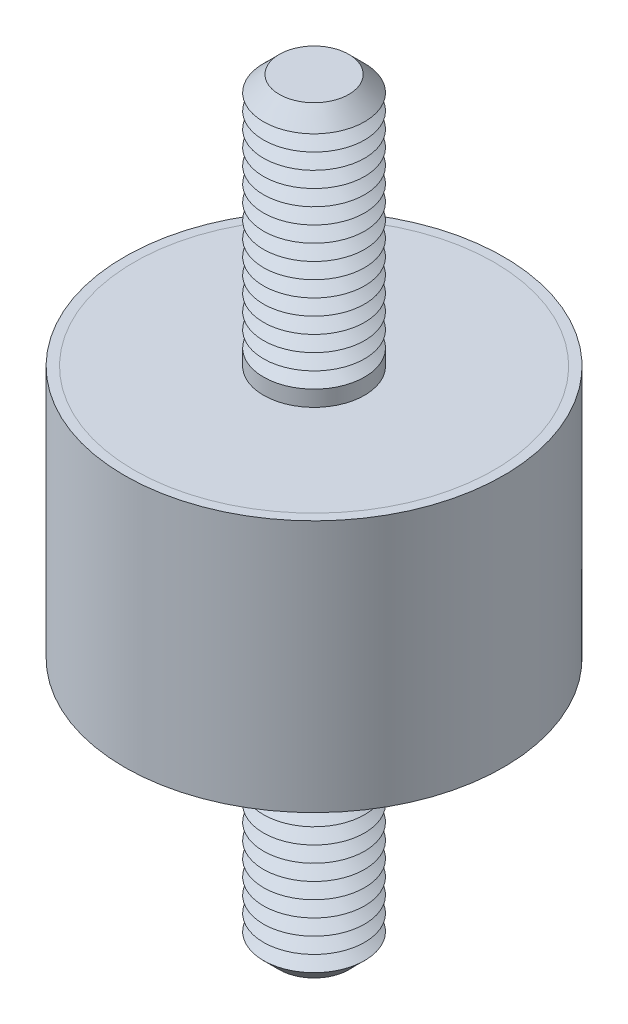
ISO-10303-21;
HEADER;
FILE_DESCRIPTION(('STEP AP214'),'2;1');
FILE_NAME('part.step','',(''),(''),'','','');
FILE_SCHEMA(('AUTOMOTIVE_DESIGN { 1 0 10303 214 1 1 1 1 }'));
ENDSEC;
DATA;
#1=APPLICATION_CONTEXT('core data for automotive mechanical design processes');
#2=APPLICATION_PROTOCOL_DEFINITION('international standard','automotive_design',2000,#1);
#3=PRODUCT_CONTEXT('',#1,'mechanical');
#4=PRODUCT('Part','Part','',(#3));
#5=PRODUCT_RELATED_PRODUCT_CATEGORY('part','',(#4));
#6=PRODUCT_DEFINITION_FORMATION('','',#4);
#7=PRODUCT_DEFINITION_CONTEXT('part definition',#1,'design');
#8=PRODUCT_DEFINITION('design','',#6,#7);
#9=PRODUCT_DEFINITION_SHAPE('','',#8);
#10=(LENGTH_UNIT() NAMED_UNIT(*) SI_UNIT(.MILLI.,.METRE.));
#11=(NAMED_UNIT(*) PLANE_ANGLE_UNIT() SI_UNIT($,.RADIAN.));
#12=(NAMED_UNIT(*) SI_UNIT($,.STERADIAN.) SOLID_ANGLE_UNIT());
#13=UNCERTAINTY_MEASURE_WITH_UNIT(LENGTH_MEASURE(1.E-05),#10,'distance_accuracy_value','');
#14=(GEOMETRIC_REPRESENTATION_CONTEXT(3) GLOBAL_UNCERTAINTY_ASSIGNED_CONTEXT((#13)) GLOBAL_UNIT_ASSIGNED_CONTEXT((#10,
#11,#12)) REPRESENTATION_CONTEXT('',''));
#15=CARTESIAN_POINT('',(0.,0.,0.));
#16=DIRECTION('',(0.,0.,1.));
#17=DIRECTION('',(1.,0.,0.));
#18=AXIS2_PLACEMENT_3D('',#15,#16,#17);
#19=CARTESIAN_POINT('',(0.,-30.,0.));
#20=DIRECTION('',(0.,1.,0.));
#21=DIRECTION('',(0.,0.,1.));
#22=AXIS2_PLACEMENT_3D('',#19,#20,#21);
#23=CYLINDRICAL_SURFACE('',#22,4.);
#24=CARTESIAN_POINT('',(0.,-10.,0.));
#25=DIRECTION('',(0.,-1.,0.));
#26=DIRECTION('',(0.,0.,-1.));
#27=AXIS2_PLACEMENT_3D('',#24,#25,#26);
#28=CIRCLE('',#27,4.);
#29=CARTESIAN_POINT('',(0.,-10.,-4.));
#30=VERTEX_POINT('',#29);
#31=EDGE_CURVE('P0_E21',#30,#30,#28,.T.);
#32=ORIENTED_EDGE('',*,*,#31,.T.);
#33=EDGE_LOOP('',(#32));
#34=FACE_BOUND('',#33,.T.);
#35=CARTESIAN_POINT('',(0.,-11.25,0.));
#36=DIRECTION('',(0.,1.,0.));
#37=DIRECTION('',(0.,0.,1.));
#38=AXIS2_PLACEMENT_3D('',#35,#36,#37);
#39=CIRCLE('',#38,4.);
#40=CARTESIAN_POINT('',(0.,-11.25,4.));
#41=VERTEX_POINT('',#40);
#42=EDGE_CURVE('P0_E33',#41,#41,#39,.T.);
#43=ORIENTED_EDGE('',*,*,#42,.T.);
#44=EDGE_LOOP('',(#43));
#45=FACE_BOUND('',#44,.T.);
#46=ADVANCED_FACE('P0_F14',(#34,#45),#23,.T.);
#47=CARTESIAN_POINT('',(0.,-10.,0.));
#48=DIRECTION('',(0.,1.,0.));
#49=DIRECTION('',(0.,0.,1.));
#50=AXIS2_PLACEMENT_3D('',#47,#48,#49);
#51=CYLINDRICAL_SURFACE('',#50,14.25);
#52=CARTESIAN_POINT('',(0.,-10.,0.));
#53=DIRECTION('',(0.,1.,0.));
#54=DIRECTION('',(0.,0.,1.));
#55=AXIS2_PLACEMENT_3D('',#52,#53,#54);
#56=CIRCLE('',#55,14.25);
#57=CARTESIAN_POINT('',(0.,-10.,14.25));
#58=VERTEX_POINT('',#57);
#59=EDGE_CURVE('P0_E25',#58,#58,#56,.T.);
#60=ORIENTED_EDGE('',*,*,#59,.T.);
#61=EDGE_LOOP('',(#60));
#62=FACE_BOUND('',#61,.T.);
#63=CARTESIAN_POINT('',(0.,-9.,0.));
#64=DIRECTION('',(0.,1.,0.));
#65=DIRECTION('',(0.,0.,1.));
#66=AXIS2_PLACEMENT_3D('',#63,#64,#65);
#67=CIRCLE('',#66,14.25);
#68=CARTESIAN_POINT('',(0.,-9.,14.25));
#69=VERTEX_POINT('',#68);
#70=EDGE_CURVE('P0_E30',#69,#69,#67,.T.);
#71=ORIENTED_EDGE('',*,*,#70,.F.);
#72=EDGE_LOOP('',(#71));
#73=FACE_BOUND('',#72,.T.);
#74=ADVANCED_FACE('P0_F145',(#62,#73),#51,.T.);
#75=CARTESIAN_POINT('',(0.,-10.,0.));
#76=DIRECTION('',(0.,1.,0.));
#77=DIRECTION('',(0.,0.,1.));
#78=AXIS2_PLACEMENT_3D('',#75,#76,#77);
#79=PLANE('',#78);
#80=ORIENTED_EDGE('',*,*,#31,.F.);
#81=EDGE_LOOP('',(#80));
#82=FACE_BOUND('',#81,.T.);
#83=ORIENTED_EDGE('',*,*,#59,.F.);
#84=EDGE_LOOP('',(#83));
#85=FACE_BOUND('',#84,.T.);
#86=ADVANCED_FACE('P0_F150',(#82,#85),#79,.F.);
#87=CARTESIAN_POINT('',(0.,-9.,0.));
#88=DIRECTION('',(0.,1.,0.));
#89=DIRECTION('',(0.,0.,1.));
#90=AXIS2_PLACEMENT_3D('',#87,#88,#89);
#91=PLANE('',#90);
#92=ORIENTED_EDGE('',*,*,#70,.T.);
#93=EDGE_LOOP('',(#92));
#94=FACE_BOUND('',#93,.T.);
#95=ADVANCED_FACE('P0_F156',(#94),#91,.T.);
#96=CARTESIAN_POINT('',(0.,-11.25,0.));
#97=DIRECTION('',(0.,1.,0.));
#98=DIRECTION('',(0.,0.,1.));
#99=AXIS2_PLACEMENT_3D('',#96,#97,#98);
#100=CONICAL_SURFACE('',#99,4.,1.0471975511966);
#101=CARTESIAN_POINT('',(0.,-11.875,0.));
#102=DIRECTION('',(0.,1.,0.));
#103=DIRECTION('',(0.,0.,1.));
#104=AXIS2_PLACEMENT_3D('',#101,#102,#103);
#105=CIRCLE('',#104,2.91746824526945);
#106=CARTESIAN_POINT('',(0.,-11.875,2.91746824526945));
#107=VERTEX_POINT('',#106);
#108=EDGE_CURVE('P0_E39',#107,#107,#105,.T.);
#109=ORIENTED_EDGE('',*,*,#108,.T.);
#110=EDGE_LOOP('',(#109));
#111=FACE_BOUND('',#110,.T.);
#112=ORIENTED_EDGE('',*,*,#42,.F.);
#113=EDGE_LOOP('',(#112));
#114=FACE_BOUND('',#113,.T.);
#115=ADVANCED_FACE('P0_F159',(#111,#114),#100,.T.);
#116=CARTESIAN_POINT('',(0.,-11.875,0.));
#117=DIRECTION('',(0.,-1.,0.));
#118=DIRECTION('',(0.,0.,-1.));
#119=AXIS2_PLACEMENT_3D('',#116,#117,#118);
#120=CONICAL_SURFACE('',#119,2.91746824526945,1.04719755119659);
#121=CARTESIAN_POINT('',(0.,-12.5,0.));
#122=DIRECTION('',(0.,1.,0.));
#123=DIRECTION('',(0.,0.,1.));
#124=AXIS2_PLACEMENT_3D('',#121,#122,#123);
#125=CIRCLE('',#124,4.);
#126=CARTESIAN_POINT('',(0.,-12.5,4.));
#127=VERTEX_POINT('',#126);
#128=EDGE_CURVE('P0_E43',#127,#127,#125,.T.);
#129=ORIENTED_EDGE('',*,*,#128,.T.);
#130=EDGE_LOOP('',(#129));
#131=FACE_BOUND('',#130,.T.);
#132=ORIENTED_EDGE('',*,*,#108,.F.);
#133=EDGE_LOOP('',(#132));
#134=FACE_BOUND('',#133,.T.);
#135=ADVANCED_FACE('P0_F163',(#131,#134),#120,.T.);
#136=CARTESIAN_POINT('',(0.,-12.5,0.));
#137=DIRECTION('',(0.,1.,0.));
#138=DIRECTION('',(0.,0.,1.));
#139=AXIS2_PLACEMENT_3D('',#136,#137,#138);
#140=CONICAL_SURFACE('',#139,4.,1.0471975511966);
#141=CARTESIAN_POINT('',(0.,-13.125,0.));
#142=DIRECTION('',(0.,1.,0.));
#143=DIRECTION('',(0.,0.,1.));
#144=AXIS2_PLACEMENT_3D('',#141,#142,#143);
#145=CIRCLE('',#144,2.91746824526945);
#146=CARTESIAN_POINT('',(0.,-13.125,2.91746824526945));
#147=VERTEX_POINT('',#146);
#148=EDGE_CURVE('P0_E47',#147,#147,#145,.T.);
#149=ORIENTED_EDGE('',*,*,#148,.T.);
#150=EDGE_LOOP('',(#149));
#151=FACE_BOUND('',#150,.T.);
#152=ORIENTED_EDGE('',*,*,#128,.F.);
#153=EDGE_LOOP('',(#152));
#154=FACE_BOUND('',#153,.T.);
#155=ADVANCED_FACE('P0_F167',(#151,#154),#140,.T.);
#156=CARTESIAN_POINT('',(0.,-13.125,0.));
#157=DIRECTION('',(0.,-1.,0.));
#158=DIRECTION('',(0.,0.,-1.));
#159=AXIS2_PLACEMENT_3D('',#156,#157,#158);
#160=CONICAL_SURFACE('',#159,2.91746824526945,1.04719755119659);
#161=CARTESIAN_POINT('',(0.,-13.75,0.));
#162=DIRECTION('',(0.,1.,0.));
#163=DIRECTION('',(0.,0.,1.));
#164=AXIS2_PLACEMENT_3D('',#161,#162,#163);
#165=CIRCLE('',#164,4.);
#166=CARTESIAN_POINT('',(0.,-13.75,4.));
#167=VERTEX_POINT('',#166);
#168=EDGE_CURVE('P0_E52',#167,#167,#165,.T.);
#169=ORIENTED_EDGE('',*,*,#168,.T.);
#170=EDGE_LOOP('',(#169));
#171=FACE_BOUND('',#170,.T.);
#172=ORIENTED_EDGE('',*,*,#148,.F.);
#173=EDGE_LOOP('',(#172));
#174=FACE_BOUND('',#173,.T.);
#175=ADVANCED_FACE('P0_F174',(#171,#174),#160,.T.);
#176=CARTESIAN_POINT('',(0.,-13.75,0.));
#177=DIRECTION('',(0.,1.,0.));
#178=DIRECTION('',(0.,0.,1.));
#179=AXIS2_PLACEMENT_3D('',#176,#177,#178);
#180=CONICAL_SURFACE('',#179,4.,1.0471975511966);
#181=CARTESIAN_POINT('',(0.,-14.375,0.));
#182=DIRECTION('',(0.,1.,0.));
#183=DIRECTION('',(0.,0.,1.));
#184=AXIS2_PLACEMENT_3D('',#181,#182,#183);
#185=CIRCLE('',#184,2.91746824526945);
#186=CARTESIAN_POINT('',(0.,-14.375,2.91746824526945));
#187=VERTEX_POINT('',#186);
#188=EDGE_CURVE('P0_E55',#187,#187,#185,.T.);
#189=ORIENTED_EDGE('',*,*,#188,.T.);
#190=EDGE_LOOP('',(#189));
#191=FACE_BOUND('',#190,.T.);
#192=ORIENTED_EDGE('',*,*,#168,.F.);
#193=EDGE_LOOP('',(#192));
#194=FACE_BOUND('',#193,.T.);
#195=ADVANCED_FACE('P0_F178',(#191,#194),#180,.T.);
#196=CARTESIAN_POINT('',(0.,-14.375,0.));
#197=DIRECTION('',(0.,-1.,0.));
#198=DIRECTION('',(0.,0.,-1.));
#199=AXIS2_PLACEMENT_3D('',#196,#197,#198);
#200=CONICAL_SURFACE('',#199,2.91746824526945,1.04719755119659);
#201=CARTESIAN_POINT('',(0.,-15.,0.));
#202=DIRECTION('',(0.,1.,0.));
#203=DIRECTION('',(0.,0.,1.));
#204=AXIS2_PLACEMENT_3D('',#201,#202,#203);
#205=CIRCLE('',#204,4.);
#206=CARTESIAN_POINT('',(0.,-15.,4.));
#207=VERTEX_POINT('',#206);
#208=EDGE_CURVE('P0_E58',#207,#207,#205,.T.);
#209=ORIENTED_EDGE('',*,*,#208,.T.);
#210=EDGE_LOOP('',(#209));
#211=FACE_BOUND('',#210,.T.);
#212=ORIENTED_EDGE('',*,*,#188,.F.);
#213=EDGE_LOOP('',(#212));
#214=FACE_BOUND('',#213,.T.);
#215=ADVANCED_FACE('P0_F182',(#211,#214),#200,.T.);
#216=CARTESIAN_POINT('',(0.,-15.,0.));
#217=DIRECTION('',(0.,1.,0.));
#218=DIRECTION('',(0.,0.,1.));
#219=AXIS2_PLACEMENT_3D('',#216,#217,#218);
#220=CONICAL_SURFACE('',#219,4.,1.0471975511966);
#221=CARTESIAN_POINT('',(0.,-15.625,0.));
#222=DIRECTION('',(0.,1.,0.));
#223=DIRECTION('',(0.,0.,1.));
#224=AXIS2_PLACEMENT_3D('',#221,#222,#223);
#225=CIRCLE('',#224,2.91746824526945);
#226=CARTESIAN_POINT('',(0.,-15.625,2.91746824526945));
#227=VERTEX_POINT('',#226);
#228=EDGE_CURVE('P0_E61',#227,#227,#225,.T.);
#229=ORIENTED_EDGE('',*,*,#228,.T.);
#230=EDGE_LOOP('',(#229));
#231=FACE_BOUND('',#230,.T.);
#232=ORIENTED_EDGE('',*,*,#208,.F.);
#233=EDGE_LOOP('',(#232));
#234=FACE_BOUND('',#233,.T.);
#235=ADVANCED_FACE('P0_F186',(#231,#234),#220,.T.);
#236=CARTESIAN_POINT('',(0.,-15.625,0.));
#237=DIRECTION('',(0.,-1.,0.));
#238=DIRECTION('',(0.,0.,-1.));
#239=AXIS2_PLACEMENT_3D('',#236,#237,#238);
#240=CONICAL_SURFACE('',#239,2.91746824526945,1.04719755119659);
#241=CARTESIAN_POINT('',(0.,-16.25,0.));
#242=DIRECTION('',(0.,1.,0.));
#243=DIRECTION('',(0.,0.,1.));
#244=AXIS2_PLACEMENT_3D('',#241,#242,#243);
#245=CIRCLE('',#244,4.);
#246=CARTESIAN_POINT('',(0.,-16.25,4.));
#247=VERTEX_POINT('',#246);
#248=EDGE_CURVE('P0_E64',#247,#247,#245,.T.);
#249=ORIENTED_EDGE('',*,*,#248,.T.);
#250=EDGE_LOOP('',(#249));
#251=FACE_BOUND('',#250,.T.);
#252=ORIENTED_EDGE('',*,*,#228,.F.);
#253=EDGE_LOOP('',(#252));
#254=FACE_BOUND('',#253,.T.);
#255=ADVANCED_FACE('P0_F190',(#251,#254),#240,.T.);
#256=CARTESIAN_POINT('',(0.,-16.25,0.));
#257=DIRECTION('',(0.,1.,0.));
#258=DIRECTION('',(0.,0.,1.));
#259=AXIS2_PLACEMENT_3D('',#256,#257,#258);
#260=CONICAL_SURFACE('',#259,4.,1.0471975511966);
#261=CARTESIAN_POINT('',(0.,-16.875,0.));
#262=DIRECTION('',(0.,1.,0.));
#263=DIRECTION('',(0.,0.,1.));
#264=AXIS2_PLACEMENT_3D('',#261,#262,#263);
#265=CIRCLE('',#264,2.91746824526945);
#266=CARTESIAN_POINT('',(0.,-16.875,2.91746824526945));
#267=VERTEX_POINT('',#266);
#268=EDGE_CURVE('P0_E67',#267,#267,#265,.T.);
#269=ORIENTED_EDGE('',*,*,#268,.T.);
#270=EDGE_LOOP('',(#269));
#271=FACE_BOUND('',#270,.T.);
#272=ORIENTED_EDGE('',*,*,#248,.F.);
#273=EDGE_LOOP('',(#272));
#274=FACE_BOUND('',#273,.T.);
#275=ADVANCED_FACE('P0_F194',(#271,#274),#260,.T.);
#276=CARTESIAN_POINT('',(0.,-16.875,0.));
#277=DIRECTION('',(0.,-1.,0.));
#278=DIRECTION('',(0.,0.,-1.));
#279=AXIS2_PLACEMENT_3D('',#276,#277,#278);
#280=CONICAL_SURFACE('',#279,2.91746824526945,1.04719755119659);
#281=CARTESIAN_POINT('',(0.,-17.5,0.));
#282=DIRECTION('',(0.,1.,0.));
#283=DIRECTION('',(0.,0.,1.));
#284=AXIS2_PLACEMENT_3D('',#281,#282,#283);
#285=CIRCLE('',#284,4.);
#286=CARTESIAN_POINT('',(0.,-17.5,4.));
#287=VERTEX_POINT('',#286);
#288=EDGE_CURVE('P0_E70',#287,#287,#285,.T.);
#289=ORIENTED_EDGE('',*,*,#288,.T.);
#290=EDGE_LOOP('',(#289));
#291=FACE_BOUND('',#290,.T.);
#292=ORIENTED_EDGE('',*,*,#268,.F.);
#293=EDGE_LOOP('',(#292));
#294=FACE_BOUND('',#293,.T.);
#295=ADVANCED_FACE('P0_F198',(#291,#294),#280,.T.);
#296=CARTESIAN_POINT('',(0.,-17.5,0.));
#297=DIRECTION('',(0.,1.,0.));
#298=DIRECTION('',(0.,0.,1.));
#299=AXIS2_PLACEMENT_3D('',#296,#297,#298);
#300=CONICAL_SURFACE('',#299,4.,1.0471975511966);
#301=CARTESIAN_POINT('',(0.,-18.125,0.));
#302=DIRECTION('',(0.,1.,0.));
#303=DIRECTION('',(0.,0.,1.));
#304=AXIS2_PLACEMENT_3D('',#301,#302,#303);
#305=CIRCLE('',#304,2.91746824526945);
#306=CARTESIAN_POINT('',(0.,-18.125,2.91746824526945));
#307=VERTEX_POINT('',#306);
#308=EDGE_CURVE('P0_E73',#307,#307,#305,.T.);
#309=ORIENTED_EDGE('',*,*,#308,.T.);
#310=EDGE_LOOP('',(#309));
#311=FACE_BOUND('',#310,.T.);
#312=ORIENTED_EDGE('',*,*,#288,.F.);
#313=EDGE_LOOP('',(#312));
#314=FACE_BOUND('',#313,.T.);
#315=ADVANCED_FACE('P0_F202',(#311,#314),#300,.T.);
#316=CARTESIAN_POINT('',(0.,-18.125,0.));
#317=DIRECTION('',(0.,-1.,0.));
#318=DIRECTION('',(0.,0.,-1.));
#319=AXIS2_PLACEMENT_3D('',#316,#317,#318);
#320=CONICAL_SURFACE('',#319,2.91746824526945,1.04719755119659);
#321=CARTESIAN_POINT('',(0.,-18.75,0.));
#322=DIRECTION('',(0.,1.,0.));
#323=DIRECTION('',(0.,0.,1.));
#324=AXIS2_PLACEMENT_3D('',#321,#322,#323);
#325=CIRCLE('',#324,4.);
#326=CARTESIAN_POINT('',(0.,-18.75,4.));
#327=VERTEX_POINT('',#326);
#328=EDGE_CURVE('P0_E76',#327,#327,#325,.T.);
#329=ORIENTED_EDGE('',*,*,#328,.T.);
#330=EDGE_LOOP('',(#329));
#331=FACE_BOUND('',#330,.T.);
#332=ORIENTED_EDGE('',*,*,#308,.F.);
#333=EDGE_LOOP('',(#332));
#334=FACE_BOUND('',#333,.T.);
#335=ADVANCED_FACE('P0_F206',(#331,#334),#320,.T.);
#336=CARTESIAN_POINT('',(0.,-18.75,0.));
#337=DIRECTION('',(0.,1.,0.));
#338=DIRECTION('',(0.,0.,1.));
#339=AXIS2_PLACEMENT_3D('',#336,#337,#338);
#340=CONICAL_SURFACE('',#339,4.,1.0471975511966);
#341=CARTESIAN_POINT('',(0.,-19.375,0.));
#342=DIRECTION('',(0.,1.,0.));
#343=DIRECTION('',(0.,0.,1.));
#344=AXIS2_PLACEMENT_3D('',#341,#342,#343);
#345=CIRCLE('',#344,2.91746824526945);
#346=CARTESIAN_POINT('',(0.,-19.375,2.91746824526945));
#347=VERTEX_POINT('',#346);
#348=EDGE_CURVE('P0_E79',#347,#347,#345,.T.);
#349=ORIENTED_EDGE('',*,*,#348,.T.);
#350=EDGE_LOOP('',(#349));
#351=FACE_BOUND('',#350,.T.);
#352=ORIENTED_EDGE('',*,*,#328,.F.);
#353=EDGE_LOOP('',(#352));
#354=FACE_BOUND('',#353,.T.);
#355=ADVANCED_FACE('P0_F210',(#351,#354),#340,.T.);
#356=CARTESIAN_POINT('',(0.,-19.375,0.));
#357=DIRECTION('',(0.,-1.,0.));
#358=DIRECTION('',(0.,0.,-1.));
#359=AXIS2_PLACEMENT_3D('',#356,#357,#358);
#360=CONICAL_SURFACE('',#359,2.91746824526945,1.04719755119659);
#361=CARTESIAN_POINT('',(0.,-20.,0.));
#362=DIRECTION('',(0.,1.,0.));
#363=DIRECTION('',(0.,0.,1.));
#364=AXIS2_PLACEMENT_3D('',#361,#362,#363);
#365=CIRCLE('',#364,4.);
#366=CARTESIAN_POINT('',(0.,-20.,4.));
#367=VERTEX_POINT('',#366);
#368=EDGE_CURVE('P0_E82',#367,#367,#365,.T.);
#369=ORIENTED_EDGE('',*,*,#368,.T.);
#370=EDGE_LOOP('',(#369));
#371=FACE_BOUND('',#370,.T.);
#372=ORIENTED_EDGE('',*,*,#348,.F.);
#373=EDGE_LOOP('',(#372));
#374=FACE_BOUND('',#373,.T.);
#375=ADVANCED_FACE('P0_F214',(#371,#374),#360,.T.);
#376=CARTESIAN_POINT('',(0.,-20.,0.));
#377=DIRECTION('',(0.,1.,0.));
#378=DIRECTION('',(0.,0.,1.));
#379=AXIS2_PLACEMENT_3D('',#376,#377,#378);
#380=CONICAL_SURFACE('',#379,4.,1.0471975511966);
#381=CARTESIAN_POINT('',(0.,-20.625,0.));
#382=DIRECTION('',(0.,1.,0.));
#383=DIRECTION('',(0.,0.,1.));
#384=AXIS2_PLACEMENT_3D('',#381,#382,#383);
#385=CIRCLE('',#384,2.91746824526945);
#386=CARTESIAN_POINT('',(0.,-20.625,2.91746824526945));
#387=VERTEX_POINT('',#386);
#388=EDGE_CURVE('P0_E85',#387,#387,#385,.T.);
#389=ORIENTED_EDGE('',*,*,#388,.T.);
#390=EDGE_LOOP('',(#389));
#391=FACE_BOUND('',#390,.T.);
#392=ORIENTED_EDGE('',*,*,#368,.F.);
#393=EDGE_LOOP('',(#392));
#394=FACE_BOUND('',#393,.T.);
#395=ADVANCED_FACE('P0_F218',(#391,#394),#380,.T.);
#396=CARTESIAN_POINT('',(0.,-20.625,0.));
#397=DIRECTION('',(0.,-1.,0.));
#398=DIRECTION('',(0.,0.,-1.));
#399=AXIS2_PLACEMENT_3D('',#396,#397,#398);
#400=CONICAL_SURFACE('',#399,2.91746824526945,1.04719755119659);
#401=CARTESIAN_POINT('',(0.,-21.25,0.));
#402=DIRECTION('',(0.,1.,0.));
#403=DIRECTION('',(0.,0.,1.));
#404=AXIS2_PLACEMENT_3D('',#401,#402,#403);
#405=CIRCLE('',#404,4.);
#406=CARTESIAN_POINT('',(0.,-21.25,4.));
#407=VERTEX_POINT('',#406);
#408=EDGE_CURVE('P0_E88',#407,#407,#405,.T.);
#409=ORIENTED_EDGE('',*,*,#408,.T.);
#410=EDGE_LOOP('',(#409));
#411=FACE_BOUND('',#410,.T.);
#412=ORIENTED_EDGE('',*,*,#388,.F.);
#413=EDGE_LOOP('',(#412));
#414=FACE_BOUND('',#413,.T.);
#415=ADVANCED_FACE('P0_F222',(#411,#414),#400,.T.);
#416=CARTESIAN_POINT('',(0.,-21.25,0.));
#417=DIRECTION('',(0.,1.,0.));
#418=DIRECTION('',(0.,0.,1.));
#419=AXIS2_PLACEMENT_3D('',#416,#417,#418);
#420=CONICAL_SURFACE('',#419,4.,1.0471975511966);
#421=CARTESIAN_POINT('',(0.,-21.875,0.));
#422=DIRECTION('',(0.,1.,0.));
#423=DIRECTION('',(0.,0.,1.));
#424=AXIS2_PLACEMENT_3D('',#421,#422,#423);
#425=CIRCLE('',#424,2.91746824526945);
#426=CARTESIAN_POINT('',(0.,-21.875,2.91746824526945));
#427=VERTEX_POINT('',#426);
#428=EDGE_CURVE('P0_E91',#427,#427,#425,.T.);
#429=ORIENTED_EDGE('',*,*,#428,.T.);
#430=EDGE_LOOP('',(#429));
#431=FACE_BOUND('',#430,.T.);
#432=ORIENTED_EDGE('',*,*,#408,.F.);
#433=EDGE_LOOP('',(#432));
#434=FACE_BOUND('',#433,.T.);
#435=ADVANCED_FACE('P0_F226',(#431,#434),#420,.T.);
#436=CARTESIAN_POINT('',(0.,-21.875,0.));
#437=DIRECTION('',(0.,-1.,0.));
#438=DIRECTION('',(0.,0.,-1.));
#439=AXIS2_PLACEMENT_3D('',#436,#437,#438);
#440=CONICAL_SURFACE('',#439,2.91746824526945,1.04719755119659);
#441=CARTESIAN_POINT('',(0.,-22.5,0.));
#442=DIRECTION('',(0.,1.,0.));
#443=DIRECTION('',(0.,0.,1.));
#444=AXIS2_PLACEMENT_3D('',#441,#442,#443);
#445=CIRCLE('',#444,4.);
#446=CARTESIAN_POINT('',(0.,-22.5,4.));
#447=VERTEX_POINT('',#446);
#448=EDGE_CURVE('P0_E94',#447,#447,#445,.T.);
#449=ORIENTED_EDGE('',*,*,#448,.T.);
#450=EDGE_LOOP('',(#449));
#451=FACE_BOUND('',#450,.T.);
#452=ORIENTED_EDGE('',*,*,#428,.F.);
#453=EDGE_LOOP('',(#452));
#454=FACE_BOUND('',#453,.T.);
#455=ADVANCED_FACE('P0_F230',(#451,#454),#440,.T.);
#456=CARTESIAN_POINT('',(0.,-22.5,0.));
#457=DIRECTION('',(0.,1.,0.));
#458=DIRECTION('',(0.,0.,1.));
#459=AXIS2_PLACEMENT_3D('',#456,#457,#458);
#460=CONICAL_SURFACE('',#459,4.,1.0471975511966);
#461=CARTESIAN_POINT('',(0.,-23.125,0.));
#462=DIRECTION('',(0.,1.,0.));
#463=DIRECTION('',(0.,0.,1.));
#464=AXIS2_PLACEMENT_3D('',#461,#462,#463);
#465=CIRCLE('',#464,2.91746824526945);
#466=CARTESIAN_POINT('',(0.,-23.125,2.91746824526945));
#467=VERTEX_POINT('',#466);
#468=EDGE_CURVE('P0_E97',#467,#467,#465,.T.);
#469=ORIENTED_EDGE('',*,*,#468,.T.);
#470=EDGE_LOOP('',(#469));
#471=FACE_BOUND('',#470,.T.);
#472=ORIENTED_EDGE('',*,*,#448,.F.);
#473=EDGE_LOOP('',(#472));
#474=FACE_BOUND('',#473,.T.);
#475=ADVANCED_FACE('P0_F234',(#471,#474),#460,.T.);
#476=CARTESIAN_POINT('',(0.,-23.125,0.));
#477=DIRECTION('',(0.,-1.,0.));
#478=DIRECTION('',(0.,0.,-1.));
#479=AXIS2_PLACEMENT_3D('',#476,#477,#478);
#480=CONICAL_SURFACE('',#479,2.91746824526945,1.04719755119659);
#481=CARTESIAN_POINT('',(0.,-23.75,0.));
#482=DIRECTION('',(0.,1.,0.));
#483=DIRECTION('',(0.,0.,1.));
#484=AXIS2_PLACEMENT_3D('',#481,#482,#483);
#485=CIRCLE('',#484,4.);
#486=CARTESIAN_POINT('',(0.,-23.75,4.));
#487=VERTEX_POINT('',#486);
#488=EDGE_CURVE('P0_E100',#487,#487,#485,.T.);
#489=ORIENTED_EDGE('',*,*,#488,.T.);
#490=EDGE_LOOP('',(#489));
#491=FACE_BOUND('',#490,.T.);
#492=ORIENTED_EDGE('',*,*,#468,.F.);
#493=EDGE_LOOP('',(#492));
#494=FACE_BOUND('',#493,.T.);
#495=ADVANCED_FACE('P0_F238',(#491,#494),#480,.T.);
#496=CARTESIAN_POINT('',(0.,-23.75,0.));
#497=DIRECTION('',(0.,1.,0.));
#498=DIRECTION('',(0.,0.,1.));
#499=AXIS2_PLACEMENT_3D('',#496,#497,#498);
#500=CONICAL_SURFACE('',#499,4.,1.0471975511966);
#501=CARTESIAN_POINT('',(0.,-24.375,0.));
#502=DIRECTION('',(0.,1.,0.));
#503=DIRECTION('',(0.,0.,1.));
#504=AXIS2_PLACEMENT_3D('',#501,#502,#503);
#505=CIRCLE('',#504,2.91746824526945);
#506=CARTESIAN_POINT('',(0.,-24.375,2.91746824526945));
#507=VERTEX_POINT('',#506);
#508=EDGE_CURVE('P0_E103',#507,#507,#505,.T.);
#509=ORIENTED_EDGE('',*,*,#508,.T.);
#510=EDGE_LOOP('',(#509));
#511=FACE_BOUND('',#510,.T.);
#512=ORIENTED_EDGE('',*,*,#488,.F.);
#513=EDGE_LOOP('',(#512));
#514=FACE_BOUND('',#513,.T.);
#515=ADVANCED_FACE('P0_F242',(#511,#514),#500,.T.);
#516=CARTESIAN_POINT('',(0.,-24.375,0.));
#517=DIRECTION('',(0.,-1.,0.));
#518=DIRECTION('',(0.,0.,-1.));
#519=AXIS2_PLACEMENT_3D('',#516,#517,#518);
#520=CONICAL_SURFACE('',#519,2.91746824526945,1.04719755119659);
#521=CARTESIAN_POINT('',(0.,-25.,0.));
#522=DIRECTION('',(0.,1.,0.));
#523=DIRECTION('',(0.,0.,1.));
#524=AXIS2_PLACEMENT_3D('',#521,#522,#523);
#525=CIRCLE('',#524,4.);
#526=CARTESIAN_POINT('',(0.,-25.,4.));
#527=VERTEX_POINT('',#526);
#528=EDGE_CURVE('P0_E106',#527,#527,#525,.T.);
#529=ORIENTED_EDGE('',*,*,#528,.T.);
#530=EDGE_LOOP('',(#529));
#531=FACE_BOUND('',#530,.T.);
#532=ORIENTED_EDGE('',*,*,#508,.F.);
#533=EDGE_LOOP('',(#532));
#534=FACE_BOUND('',#533,.T.);
#535=ADVANCED_FACE('P0_F246',(#531,#534),#520,.T.);
#536=CARTESIAN_POINT('',(0.,-25.,0.));
#537=DIRECTION('',(0.,1.,0.));
#538=DIRECTION('',(0.,0.,1.));
#539=AXIS2_PLACEMENT_3D('',#536,#537,#538);
#540=CONICAL_SURFACE('',#539,4.,1.0471975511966);
#541=CARTESIAN_POINT('',(0.,-25.625,0.));
#542=DIRECTION('',(0.,1.,0.));
#543=DIRECTION('',(0.,0.,1.));
#544=AXIS2_PLACEMENT_3D('',#541,#542,#543);
#545=CIRCLE('',#544,2.91746824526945);
#546=CARTESIAN_POINT('',(0.,-25.625,2.91746824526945));
#547=VERTEX_POINT('',#546);
#548=EDGE_CURVE('P0_E109',#547,#547,#545,.T.);
#549=ORIENTED_EDGE('',*,*,#548,.T.);
#550=EDGE_LOOP('',(#549));
#551=FACE_BOUND('',#550,.T.);
#552=ORIENTED_EDGE('',*,*,#528,.F.);
#553=EDGE_LOOP('',(#552));
#554=FACE_BOUND('',#553,.T.);
#555=ADVANCED_FACE('P0_F250',(#551,#554),#540,.T.);
#556=CARTESIAN_POINT('',(0.,-25.625,0.));
#557=DIRECTION('',(0.,-1.,0.));
#558=DIRECTION('',(0.,0.,-1.));
#559=AXIS2_PLACEMENT_3D('',#556,#557,#558);
#560=CONICAL_SURFACE('',#559,2.91746824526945,1.04719755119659);
#561=CARTESIAN_POINT('',(0.,-26.25,0.));
#562=DIRECTION('',(0.,1.,0.));
#563=DIRECTION('',(0.,0.,1.));
#564=AXIS2_PLACEMENT_3D('',#561,#562,#563);
#565=CIRCLE('',#564,4.);
#566=CARTESIAN_POINT('',(0.,-26.25,4.));
#567=VERTEX_POINT('',#566);
#568=EDGE_CURVE('P0_E112',#567,#567,#565,.T.);
#569=ORIENTED_EDGE('',*,*,#568,.T.);
#570=EDGE_LOOP('',(#569));
#571=FACE_BOUND('',#570,.T.);
#572=ORIENTED_EDGE('',*,*,#548,.F.);
#573=EDGE_LOOP('',(#572));
#574=FACE_BOUND('',#573,.T.);
#575=ADVANCED_FACE('P0_F254',(#571,#574),#560,.T.);
#576=CARTESIAN_POINT('',(0.,-26.25,0.));
#577=DIRECTION('',(0.,1.,0.));
#578=DIRECTION('',(0.,0.,1.));
#579=AXIS2_PLACEMENT_3D('',#576,#577,#578);
#580=CONICAL_SURFACE('',#579,4.,1.0471975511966);
#581=CARTESIAN_POINT('',(0.,-26.875,0.));
#582=DIRECTION('',(0.,1.,0.));
#583=DIRECTION('',(0.,0.,1.));
#584=AXIS2_PLACEMENT_3D('',#581,#582,#583);
#585=CIRCLE('',#584,2.91746824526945);
#586=CARTESIAN_POINT('',(0.,-26.875,2.91746824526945));
#587=VERTEX_POINT('',#586);
#588=EDGE_CURVE('P0_E115',#587,#587,#585,.T.);
#589=ORIENTED_EDGE('',*,*,#588,.T.);
#590=EDGE_LOOP('',(#589));
#591=FACE_BOUND('',#590,.T.);
#592=ORIENTED_EDGE('',*,*,#568,.F.);
#593=EDGE_LOOP('',(#592));
#594=FACE_BOUND('',#593,.T.);
#595=ADVANCED_FACE('P0_F258',(#591,#594),#580,.T.);
#596=CARTESIAN_POINT('',(0.,-26.875,0.));
#597=DIRECTION('',(0.,-1.,0.));
#598=DIRECTION('',(0.,0.,-1.));
#599=AXIS2_PLACEMENT_3D('',#596,#597,#598);
#600=CONICAL_SURFACE('',#599,2.91746824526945,1.04719755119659);
#601=CARTESIAN_POINT('',(0.,-27.5,0.));
#602=DIRECTION('',(0.,1.,0.));
#603=DIRECTION('',(0.,0.,1.));
#604=AXIS2_PLACEMENT_3D('',#601,#602,#603);
#605=CIRCLE('',#604,4.);
#606=CARTESIAN_POINT('',(0.,-27.5,4.));
#607=VERTEX_POINT('',#606);
#608=EDGE_CURVE('P0_E118',#607,#607,#605,.T.);
#609=ORIENTED_EDGE('',*,*,#608,.T.);
#610=EDGE_LOOP('',(#609));
#611=FACE_BOUND('',#610,.T.);
#612=ORIENTED_EDGE('',*,*,#588,.F.);
#613=EDGE_LOOP('',(#612));
#614=FACE_BOUND('',#613,.T.);
#615=ADVANCED_FACE('P0_F142',(#611,#614),#600,.T.);
#616=CARTESIAN_POINT('',(0.,-27.5,0.));
#617=DIRECTION('',(0.,1.,0.));
#618=DIRECTION('',(0.,0.,1.));
#619=AXIS2_PLACEMENT_3D('',#616,#617,#618);
#620=CONICAL_SURFACE('',#619,4.,1.0471975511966);
#621=CARTESIAN_POINT('',(0.,-28.125,0.));
#622=DIRECTION('',(0.,1.,0.));
#623=DIRECTION('',(0.,0.,1.));
#624=AXIS2_PLACEMENT_3D('',#621,#622,#623);
#625=CIRCLE('',#624,2.91746824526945);
#626=CARTESIAN_POINT('',(0.,-28.125,2.91746824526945));
#627=VERTEX_POINT('',#626);
#628=EDGE_CURVE('P0_E124',#627,#627,#625,.T.);
#629=ORIENTED_EDGE('',*,*,#628,.T.);
#630=EDGE_LOOP('',(#629));
#631=FACE_BOUND('',#630,.T.);
#632=ORIENTED_EDGE('',*,*,#608,.F.);
#633=EDGE_LOOP('',(#632));
#634=FACE_BOUND('',#633,.T.);
#635=ADVANCED_FACE('P0_F128',(#631,#634),#620,.T.);
#636=CARTESIAN_POINT('',(0.,-28.125,0.));
#637=DIRECTION('',(0.,-1.,0.));
#638=DIRECTION('',(0.,0.,-1.));
#639=AXIS2_PLACEMENT_3D('',#636,#637,#638);
#640=CONICAL_SURFACE('',#639,2.91746824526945,1.04719755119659);
#641=CARTESIAN_POINT('',(0.,-28.75,0.));
#642=DIRECTION('',(0.,1.,0.));
#643=DIRECTION('',(0.,0.,1.));
#644=AXIS2_PLACEMENT_3D('',#641,#642,#643);
#645=CIRCLE('',#644,4.);
#646=CARTESIAN_POINT('',(0.,-28.75,4.));
#647=VERTEX_POINT('',#646);
#648=EDGE_CURVE('P0_E121',#647,#647,#645,.T.);
#649=ORIENTED_EDGE('',*,*,#648,.T.);
#650=EDGE_LOOP('',(#649));
#651=FACE_BOUND('',#650,.T.);
#652=ORIENTED_EDGE('',*,*,#628,.F.);
#653=EDGE_LOOP('',(#652));
#654=FACE_BOUND('',#653,.T.);
#655=ADVANCED_FACE('P0_F131',(#651,#654),#640,.T.);
#656=CARTESIAN_POINT('',(0.,-30.,0.));
#657=DIRECTION('',(0.,-1.,0.));
#658=DIRECTION('',(0.,0.,-1.));
#659=AXIS2_PLACEMENT_3D('',#656,#657,#658);
#660=PLANE('',#659);
#661=CARTESIAN_POINT('',(0.,-30.,0.));
#662=DIRECTION('',(0.,-1.,0.));
#663=DIRECTION('',(0.,0.,-1.));
#664=AXIS2_PLACEMENT_3D('',#661,#662,#663);
#665=CIRCLE('',#664,2.75000000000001);
#666=CARTESIAN_POINT('',(0.,-30.,-2.75000000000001));
#667=VERTEX_POINT('',#666);
#668=EDGE_CURVE('P0_E10',#667,#667,#665,.T.);
#669=ORIENTED_EDGE('',*,*,#668,.T.);
#670=EDGE_LOOP('',(#669));
#671=FACE_BOUND('',#670,.T.);
#672=ADVANCED_FACE('P0_F133',(#671),#660,.T.);
#673=CARTESIAN_POINT('',(0.,-30.,0.));
#674=DIRECTION('',(0.,1.,0.));
#675=DIRECTION('',(0.,0.,1.));
#676=AXIS2_PLACEMENT_3D('',#673,#674,#675);
#677=CONICAL_SURFACE('',#676,2.75000000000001,0.785398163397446);
#678=ORIENTED_EDGE('',*,*,#648,.F.);
#679=EDGE_LOOP('',(#678));
#680=FACE_BOUND('',#679,.T.);
#681=ORIENTED_EDGE('',*,*,#668,.F.);
#682=EDGE_LOOP('',(#681));
#683=FACE_BOUND('',#682,.T.);
#684=ADVANCED_FACE('P0_F16',(#680,#683),#677,.T.);
#685=CLOSED_SHELL('',(#46,#74,#86,#95,#115,#135,#155,#175,#195,#215,#235,#255,#275,#295,#315,
#335,#355,#375,#395,#415,#435,#455,#475,#495,#515,#535,#555,#575,#595,#615,#635,#655,#672,#684));
#686=MANIFOLD_SOLID_BREP('P0_B1',#685);
#687=CARTESIAN_POINT('',(0.,30.,0.));
#688=DIRECTION('',(0.,-1.,0.));
#689=DIRECTION('',(0.,0.,-1.));
#690=AXIS2_PLACEMENT_3D('',#687,#688,#689);
#691=CYLINDRICAL_SURFACE('',#690,4.);
#692=CARTESIAN_POINT('',(0.,11.25,0.));
#693=DIRECTION('',(0.,1.,0.));
#694=DIRECTION('',(0.,0.,1.));
#695=AXIS2_PLACEMENT_3D('',#692,#693,#694);
#696=CIRCLE('',#695,4.);
#697=CARTESIAN_POINT('',(0.,11.25,4.));
#698=VERTEX_POINT('',#697);
#699=EDGE_CURVE('P1_E33',#698,#698,#696,.T.);
#700=ORIENTED_EDGE('',*,*,#699,.F.);
#701=EDGE_LOOP('',(#700));
#702=FACE_BOUND('',#701,.T.);
#703=CARTESIAN_POINT('',(0.,10.,0.));
#704=DIRECTION('',(0.,1.,0.));
#705=DIRECTION('',(0.,0.,1.));
#706=AXIS2_PLACEMENT_3D('',#703,#704,#705);
#707=CIRCLE('',#706,4.);
#708=CARTESIAN_POINT('',(0.,10.,4.));
#709=VERTEX_POINT('',#708);
#710=EDGE_CURVE('P1_E21',#709,#709,#707,.T.);
#711=ORIENTED_EDGE('',*,*,#710,.T.);
#712=EDGE_LOOP('',(#711));
#713=FACE_BOUND('',#712,.T.);
#714=ADVANCED_FACE('P1_F14',(#702,#713),#691,.T.);
#715=CARTESIAN_POINT('',(0.,10.,0.));
#716=DIRECTION('',(0.,-1.,0.));
#717=DIRECTION('',(0.,0.,-1.));
#718=AXIS2_PLACEMENT_3D('',#715,#716,#717);
#719=CYLINDRICAL_SURFACE('',#718,14.25);
#720=CARTESIAN_POINT('',(0.,10.,0.));
#721=DIRECTION('',(0.,1.,0.));
#722=DIRECTION('',(0.,0.,1.));
#723=AXIS2_PLACEMENT_3D('',#720,#721,#722);
#724=CIRCLE('',#723,14.25);
#725=CARTESIAN_POINT('',(0.,10.,14.25));
#726=VERTEX_POINT('',#725);
#727=EDGE_CURVE('P1_E25',#726,#726,#724,.T.);
#728=ORIENTED_EDGE('',*,*,#727,.F.);
#729=EDGE_LOOP('',(#728));
#730=FACE_BOUND('',#729,.T.);
#731=CARTESIAN_POINT('',(0.,9.,0.));
#732=DIRECTION('',(0.,1.,0.));
#733=DIRECTION('',(0.,0.,1.));
#734=AXIS2_PLACEMENT_3D('',#731,#732,#733);
#735=CIRCLE('',#734,14.25);
#736=CARTESIAN_POINT('',(0.,9.,14.25));
#737=VERTEX_POINT('',#736);
#738=EDGE_CURVE('P1_E30',#737,#737,#735,.T.);
#739=ORIENTED_EDGE('',*,*,#738,.T.);
#740=EDGE_LOOP('',(#739));
#741=FACE_BOUND('',#740,.T.);
#742=ADVANCED_FACE('P1_F292',(#730,#741),#719,.T.);
#743=CARTESIAN_POINT('',(0.,10.,0.));
#744=DIRECTION('',(0.,1.,0.));
#745=DIRECTION('',(0.,0.,1.));
#746=AXIS2_PLACEMENT_3D('',#743,#744,#745);
#747=PLANE('',#746);
#748=ORIENTED_EDGE('',*,*,#710,.F.);
#749=EDGE_LOOP('',(#748));
#750=FACE_BOUND('',#749,.T.);
#751=ORIENTED_EDGE('',*,*,#727,.T.);
#752=EDGE_LOOP('',(#751));
#753=FACE_BOUND('',#752,.T.);
#754=ADVANCED_FACE('P1_F298',(#750,#753),#747,.T.);
#755=CARTESIAN_POINT('',(0.,9.,0.));
#756=DIRECTION('',(0.,1.,0.));
#757=DIRECTION('',(0.,0.,1.));
#758=AXIS2_PLACEMENT_3D('',#755,#756,#757);
#759=PLANE('',#758);
#760=ORIENTED_EDGE('',*,*,#738,.F.);
#761=EDGE_LOOP('',(#760));
#762=FACE_BOUND('',#761,.T.);
#763=ADVANCED_FACE('P1_F288',(#762),#759,.F.);
#764=CARTESIAN_POINT('',(0.,11.25,0.));
#765=DIRECTION('',(0.,-1.,0.));
#766=DIRECTION('',(0.,0.,-1.));
#767=AXIS2_PLACEMENT_3D('',#764,#765,#766);
#768=CONICAL_SURFACE('',#767,4.,1.0471975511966);
#769=CARTESIAN_POINT('',(0.,11.875,0.));
#770=DIRECTION('',(0.,1.,0.));
#771=DIRECTION('',(0.,0.,1.));
#772=AXIS2_PLACEMENT_3D('',#769,#770,#771);
#773=CIRCLE('',#772,2.91746824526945);
#774=CARTESIAN_POINT('',(0.,11.875,2.91746824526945));
#775=VERTEX_POINT('',#774);
#776=EDGE_CURVE('P1_E39',#775,#775,#773,.T.);
#777=ORIENTED_EDGE('',*,*,#776,.F.);
#778=EDGE_LOOP('',(#777));
#779=FACE_BOUND('',#778,.T.);
#780=ORIENTED_EDGE('',*,*,#699,.T.);
#781=EDGE_LOOP('',(#780));
#782=FACE_BOUND('',#781,.T.);
#783=ADVANCED_FACE('P1_F282',(#779,#782),#768,.T.);
#784=CARTESIAN_POINT('',(0.,11.875,0.));
#785=DIRECTION('',(0.,1.,0.));
#786=DIRECTION('',(0.,0.,1.));
#787=AXIS2_PLACEMENT_3D('',#784,#785,#786);
#788=CONICAL_SURFACE('',#787,2.91746824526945,1.04719755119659);
#789=CARTESIAN_POINT('',(0.,12.5,0.));
#790=DIRECTION('',(0.,1.,0.));
#791=DIRECTION('',(0.,0.,1.));
#792=AXIS2_PLACEMENT_3D('',#789,#790,#791);
#793=CIRCLE('',#792,4.);
#794=CARTESIAN_POINT('',(0.,12.5,4.));
#795=VERTEX_POINT('',#794);
#796=EDGE_CURVE('P1_E43',#795,#795,#793,.T.);
#797=ORIENTED_EDGE('',*,*,#796,.F.);
#798=EDGE_LOOP('',(#797));
#799=FACE_BOUND('',#798,.T.);
#800=ORIENTED_EDGE('',*,*,#776,.T.);
#801=EDGE_LOOP('',(#800));
#802=FACE_BOUND('',#801,.T.);
#803=ADVANCED_FACE('P1_F277',(#799,#802),#788,.T.);
#804=CARTESIAN_POINT('',(0.,12.5,0.));
#805=DIRECTION('',(0.,-1.,0.));
#806=DIRECTION('',(0.,0.,-1.));
#807=AXIS2_PLACEMENT_3D('',#804,#805,#806);
#808=CONICAL_SURFACE('',#807,4.,1.0471975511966);
#809=CARTESIAN_POINT('',(0.,13.125,0.));
#810=DIRECTION('',(0.,1.,0.));
#811=DIRECTION('',(0.,0.,1.));
#812=AXIS2_PLACEMENT_3D('',#809,#810,#811);
#813=CIRCLE('',#812,2.91746824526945);
#814=CARTESIAN_POINT('',(0.,13.125,2.91746824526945));
#815=VERTEX_POINT('',#814);
#816=EDGE_CURVE('P1_E47',#815,#815,#813,.T.);
#817=ORIENTED_EDGE('',*,*,#816,.F.);
#818=EDGE_LOOP('',(#817));
#819=FACE_BOUND('',#818,.T.);
#820=ORIENTED_EDGE('',*,*,#796,.T.);
#821=EDGE_LOOP('',(#820));
#822=FACE_BOUND('',#821,.T.);
#823=ADVANCED_FACE('P1_F271',(#819,#822),#808,.T.);
#824=CARTESIAN_POINT('',(0.,13.125,0.));
#825=DIRECTION('',(0.,1.,0.));
#826=DIRECTION('',(0.,0.,1.));
#827=AXIS2_PLACEMENT_3D('',#824,#825,#826);
#828=CONICAL_SURFACE('',#827,2.91746824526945,1.04719755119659);
#829=CARTESIAN_POINT('',(0.,13.75,0.));
#830=DIRECTION('',(0.,1.,0.));
#831=DIRECTION('',(0.,0.,1.));
#832=AXIS2_PLACEMENT_3D('',#829,#830,#831);
#833=CIRCLE('',#832,4.);
#834=CARTESIAN_POINT('',(0.,13.75,4.));
#835=VERTEX_POINT('',#834);
#836=EDGE_CURVE('P1_E52',#835,#835,#833,.T.);
#837=ORIENTED_EDGE('',*,*,#836,.F.);
#838=EDGE_LOOP('',(#837));
#839=FACE_BOUND('',#838,.T.);
#840=ORIENTED_EDGE('',*,*,#816,.T.);
#841=EDGE_LOOP('',(#840));
#842=FACE_BOUND('',#841,.T.);
#843=ADVANCED_FACE('P1_F265',(#839,#842),#828,.T.);
#844=CARTESIAN_POINT('',(0.,13.75,0.));
#845=DIRECTION('',(0.,-1.,0.));
#846=DIRECTION('',(0.,0.,-1.));
#847=AXIS2_PLACEMENT_3D('',#844,#845,#846);
#848=CONICAL_SURFACE('',#847,4.,1.0471975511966);
#849=CARTESIAN_POINT('',(0.,14.375,0.));
#850=DIRECTION('',(0.,1.,0.));
#851=DIRECTION('',(0.,0.,1.));
#852=AXIS2_PLACEMENT_3D('',#849,#850,#851);
#853=CIRCLE('',#852,2.91746824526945);
#854=CARTESIAN_POINT('',(0.,14.375,2.91746824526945));
#855=VERTEX_POINT('',#854);
#856=EDGE_CURVE('P1_E55',#855,#855,#853,.T.);
#857=ORIENTED_EDGE('',*,*,#856,.F.);
#858=EDGE_LOOP('',(#857));
#859=FACE_BOUND('',#858,.T.);
#860=ORIENTED_EDGE('',*,*,#836,.T.);
#861=EDGE_LOOP('',(#860));
#862=FACE_BOUND('',#861,.T.);
#863=ADVANCED_FACE('P1_F259',(#859,#862),#848,.T.);
#864=CARTESIAN_POINT('',(0.,14.375,0.));
#865=DIRECTION('',(0.,1.,0.));
#866=DIRECTION('',(0.,0.,1.));
#867=AXIS2_PLACEMENT_3D('',#864,#865,#866);
#868=CONICAL_SURFACE('',#867,2.91746824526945,1.04719755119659);
#869=CARTESIAN_POINT('',(0.,15.,0.));
#870=DIRECTION('',(0.,1.,0.));
#871=DIRECTION('',(0.,0.,1.));
#872=AXIS2_PLACEMENT_3D('',#869,#870,#871);
#873=CIRCLE('',#872,4.);
#874=CARTESIAN_POINT('',(0.,15.,4.));
#875=VERTEX_POINT('',#874);
#876=EDGE_CURVE('P1_E58',#875,#875,#873,.T.);
#877=ORIENTED_EDGE('',*,*,#876,.F.);
#878=EDGE_LOOP('',(#877));
#879=FACE_BOUND('',#878,.T.);
#880=ORIENTED_EDGE('',*,*,#856,.T.);
#881=EDGE_LOOP('',(#880));
#882=FACE_BOUND('',#881,.T.);
#883=ADVANCED_FACE('P1_F253',(#879,#882),#868,.T.);
#884=CARTESIAN_POINT('',(0.,15.,0.));
#885=DIRECTION('',(0.,-1.,0.));
#886=DIRECTION('',(0.,0.,-1.));
#887=AXIS2_PLACEMENT_3D('',#884,#885,#886);
#888=CONICAL_SURFACE('',#887,4.,1.0471975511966);
#889=CARTESIAN_POINT('',(0.,15.625,0.));
#890=DIRECTION('',(0.,1.,0.));
#891=DIRECTION('',(0.,0.,1.));
#892=AXIS2_PLACEMENT_3D('',#889,#890,#891);
#893=CIRCLE('',#892,2.91746824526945);
#894=CARTESIAN_POINT('',(0.,15.625,2.91746824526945));
#895=VERTEX_POINT('',#894);
#896=EDGE_CURVE('P1_E61',#895,#895,#893,.T.);
#897=ORIENTED_EDGE('',*,*,#896,.F.);
#898=EDGE_LOOP('',(#897));
#899=FACE_BOUND('',#898,.T.);
#900=ORIENTED_EDGE('',*,*,#876,.T.);
#901=EDGE_LOOP('',(#900));
#902=FACE_BOUND('',#901,.T.);
#903=ADVANCED_FACE('P1_F247',(#899,#902),#888,.T.);
#904=CARTESIAN_POINT('',(0.,15.625,0.));
#905=DIRECTION('',(0.,1.,0.));
#906=DIRECTION('',(0.,0.,1.));
#907=AXIS2_PLACEMENT_3D('',#904,#905,#906);
#908=CONICAL_SURFACE('',#907,2.91746824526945,1.04719755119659);
#909=CARTESIAN_POINT('',(0.,16.25,0.));
#910=DIRECTION('',(0.,1.,0.));
#911=DIRECTION('',(0.,0.,1.));
#912=AXIS2_PLACEMENT_3D('',#909,#910,#911);
#913=CIRCLE('',#912,4.);
#914=CARTESIAN_POINT('',(0.,16.25,4.));
#915=VERTEX_POINT('',#914);
#916=EDGE_CURVE('P1_E64',#915,#915,#913,.T.);
#917=ORIENTED_EDGE('',*,*,#916,.F.);
#918=EDGE_LOOP('',(#917));
#919=FACE_BOUND('',#918,.T.);
#920=ORIENTED_EDGE('',*,*,#896,.T.);
#921=EDGE_LOOP('',(#920));
#922=FACE_BOUND('',#921,.T.);
#923=ADVANCED_FACE('P1_F241',(#919,#922),#908,.T.);
#924=CARTESIAN_POINT('',(0.,16.25,0.));
#925=DIRECTION('',(0.,-1.,0.));
#926=DIRECTION('',(0.,0.,-1.));
#927=AXIS2_PLACEMENT_3D('',#924,#925,#926);
#928=CONICAL_SURFACE('',#927,4.,1.0471975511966);
#929=CARTESIAN_POINT('',(0.,16.875,0.));
#930=DIRECTION('',(0.,1.,0.));
#931=DIRECTION('',(0.,0.,1.));
#932=AXIS2_PLACEMENT_3D('',#929,#930,#931);
#933=CIRCLE('',#932,2.91746824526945);
#934=CARTESIAN_POINT('',(0.,16.875,2.91746824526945));
#935=VERTEX_POINT('',#934);
#936=EDGE_CURVE('P1_E67',#935,#935,#933,.T.);
#937=ORIENTED_EDGE('',*,*,#936,.F.);
#938=EDGE_LOOP('',(#937));
#939=FACE_BOUND('',#938,.T.);
#940=ORIENTED_EDGE('',*,*,#916,.T.);
#941=EDGE_LOOP('',(#940));
#942=FACE_BOUND('',#941,.T.);
#943=ADVANCED_FACE('P1_F235',(#939,#942),#928,.T.);
#944=CARTESIAN_POINT('',(0.,16.875,0.));
#945=DIRECTION('',(0.,1.,0.));
#946=DIRECTION('',(0.,0.,1.));
#947=AXIS2_PLACEMENT_3D('',#944,#945,#946);
#948=CONICAL_SURFACE('',#947,2.91746824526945,1.04719755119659);
#949=CARTESIAN_POINT('',(0.,17.5,0.));
#950=DIRECTION('',(0.,1.,0.));
#951=DIRECTION('',(0.,0.,1.));
#952=AXIS2_PLACEMENT_3D('',#949,#950,#951);
#953=CIRCLE('',#952,4.);
#954=CARTESIAN_POINT('',(0.,17.5,4.));
#955=VERTEX_POINT('',#954);
#956=EDGE_CURVE('P1_E70',#955,#955,#953,.T.);
#957=ORIENTED_EDGE('',*,*,#956,.F.);
#958=EDGE_LOOP('',(#957));
#959=FACE_BOUND('',#958,.T.);
#960=ORIENTED_EDGE('',*,*,#936,.T.);
#961=EDGE_LOOP('',(#960));
#962=FACE_BOUND('',#961,.T.);
#963=ADVANCED_FACE('P1_F229',(#959,#962),#948,.T.);
#964=CARTESIAN_POINT('',(0.,17.5,0.));
#965=DIRECTION('',(0.,-1.,0.));
#966=DIRECTION('',(0.,0.,-1.));
#967=AXIS2_PLACEMENT_3D('',#964,#965,#966);
#968=CONICAL_SURFACE('',#967,4.,1.0471975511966);
#969=CARTESIAN_POINT('',(0.,18.125,0.));
#970=DIRECTION('',(0.,1.,0.));
#971=DIRECTION('',(0.,0.,1.));
#972=AXIS2_PLACEMENT_3D('',#969,#970,#971);
#973=CIRCLE('',#972,2.91746824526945);
#974=CARTESIAN_POINT('',(0.,18.125,2.91746824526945));
#975=VERTEX_POINT('',#974);
#976=EDGE_CURVE('P1_E73',#975,#975,#973,.T.);
#977=ORIENTED_EDGE('',*,*,#976,.F.);
#978=EDGE_LOOP('',(#977));
#979=FACE_BOUND('',#978,.T.);
#980=ORIENTED_EDGE('',*,*,#956,.T.);
#981=EDGE_LOOP('',(#980));
#982=FACE_BOUND('',#981,.T.);
#983=ADVANCED_FACE('P1_F223',(#979,#982),#968,.T.);
#984=CARTESIAN_POINT('',(0.,18.125,0.));
#985=DIRECTION('',(0.,1.,0.));
#986=DIRECTION('',(0.,0.,1.));
#987=AXIS2_PLACEMENT_3D('',#984,#985,#986);
#988=CONICAL_SURFACE('',#987,2.91746824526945,1.04719755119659);
#989=CARTESIAN_POINT('',(0.,18.75,0.));
#990=DIRECTION('',(0.,1.,0.));
#991=DIRECTION('',(0.,0.,1.));
#992=AXIS2_PLACEMENT_3D('',#989,#990,#991);
#993=CIRCLE('',#992,4.);
#994=CARTESIAN_POINT('',(0.,18.75,4.));
#995=VERTEX_POINT('',#994);
#996=EDGE_CURVE('P1_E76',#995,#995,#993,.T.);
#997=ORIENTED_EDGE('',*,*,#996,.F.);
#998=EDGE_LOOP('',(#997));
#999=FACE_BOUND('',#998,.T.);
#1000=ORIENTED_EDGE('',*,*,#976,.T.);
#1001=EDGE_LOOP('',(#1000));
#1002=FACE_BOUND('',#1001,.T.);
#1003=ADVANCED_FACE('P1_F217',(#999,#1002),#988,.T.);
#1004=CARTESIAN_POINT('',(0.,18.75,0.));
#1005=DIRECTION('',(0.,-1.,0.));
#1006=DIRECTION('',(0.,0.,-1.));
#1007=AXIS2_PLACEMENT_3D('',#1004,#1005,#1006);
#1008=CONICAL_SURFACE('',#1007,4.,1.0471975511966);
#1009=CARTESIAN_POINT('',(0.,19.375,0.));
#1010=DIRECTION('',(0.,1.,0.));
#1011=DIRECTION('',(0.,0.,1.));
#1012=AXIS2_PLACEMENT_3D('',#1009,#1010,#1011);
#1013=CIRCLE('',#1012,2.91746824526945);
#1014=CARTESIAN_POINT('',(0.,19.375,2.91746824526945));
#1015=VERTEX_POINT('',#1014);
#1016=EDGE_CURVE('P1_E79',#1015,#1015,#1013,.T.);
#1017=ORIENTED_EDGE('',*,*,#1016,.F.);
#1018=EDGE_LOOP('',(#1017));
#1019=FACE_BOUND('',#1018,.T.);
#1020=ORIENTED_EDGE('',*,*,#996,.T.);
#1021=EDGE_LOOP('',(#1020));
#1022=FACE_BOUND('',#1021,.T.);
#1023=ADVANCED_FACE('P1_F211',(#1019,#1022),#1008,.T.);
#1024=CARTESIAN_POINT('',(0.,19.375,0.));
#1025=DIRECTION('',(0.,1.,0.));
#1026=DIRECTION('',(0.,0.,1.));
#1027=AXIS2_PLACEMENT_3D('',#1024,#1025,#1026);
#1028=CONICAL_SURFACE('',#1027,2.91746824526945,1.04719755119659);
#1029=CARTESIAN_POINT('',(0.,20.,0.));
#1030=DIRECTION('',(0.,1.,0.));
#1031=DIRECTION('',(0.,0.,1.));
#1032=AXIS2_PLACEMENT_3D('',#1029,#1030,#1031);
#1033=CIRCLE('',#1032,4.);
#1034=CARTESIAN_POINT('',(0.,20.,4.));
#1035=VERTEX_POINT('',#1034);
#1036=EDGE_CURVE('P1_E82',#1035,#1035,#1033,.T.);
#1037=ORIENTED_EDGE('',*,*,#1036,.F.);
#1038=EDGE_LOOP('',(#1037));
#1039=FACE_BOUND('',#1038,.T.);
#1040=ORIENTED_EDGE('',*,*,#1016,.T.);
#1041=EDGE_LOOP('',(#1040));
#1042=FACE_BOUND('',#1041,.T.);
#1043=ADVANCED_FACE('P1_F205',(#1039,#1042),#1028,.T.);
#1044=CARTESIAN_POINT('',(0.,20.,0.));
#1045=DIRECTION('',(0.,-1.,0.));
#1046=DIRECTION('',(0.,0.,-1.));
#1047=AXIS2_PLACEMENT_3D('',#1044,#1045,#1046);
#1048=CONICAL_SURFACE('',#1047,4.,1.0471975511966);
#1049=CARTESIAN_POINT('',(0.,20.625,0.));
#1050=DIRECTION('',(0.,1.,0.));
#1051=DIRECTION('',(0.,0.,1.));
#1052=AXIS2_PLACEMENT_3D('',#1049,#1050,#1051);
#1053=CIRCLE('',#1052,2.91746824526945);
#1054=CARTESIAN_POINT('',(0.,20.625,2.91746824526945));
#1055=VERTEX_POINT('',#1054);
#1056=EDGE_CURVE('P1_E85',#1055,#1055,#1053,.T.);
#1057=ORIENTED_EDGE('',*,*,#1056,.F.);
#1058=EDGE_LOOP('',(#1057));
#1059=FACE_BOUND('',#1058,.T.);
#1060=ORIENTED_EDGE('',*,*,#1036,.T.);
#1061=EDGE_LOOP('',(#1060));
#1062=FACE_BOUND('',#1061,.T.);
#1063=ADVANCED_FACE('P1_F199',(#1059,#1062),#1048,.T.);
#1064=CARTESIAN_POINT('',(0.,20.625,0.));
#1065=DIRECTION('',(0.,1.,0.));
#1066=DIRECTION('',(0.,0.,1.));
#1067=AXIS2_PLACEMENT_3D('',#1064,#1065,#1066);
#1068=CONICAL_SURFACE('',#1067,2.91746824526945,1.04719755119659);
#1069=CARTESIAN_POINT('',(0.,21.25,0.));
#1070=DIRECTION('',(0.,1.,0.));
#1071=DIRECTION('',(0.,0.,1.));
#1072=AXIS2_PLACEMENT_3D('',#1069,#1070,#1071);
#1073=CIRCLE('',#1072,4.);
#1074=CARTESIAN_POINT('',(0.,21.25,4.));
#1075=VERTEX_POINT('',#1074);
#1076=EDGE_CURVE('P1_E88',#1075,#1075,#1073,.T.);
#1077=ORIENTED_EDGE('',*,*,#1076,.F.);
#1078=EDGE_LOOP('',(#1077));
#1079=FACE_BOUND('',#1078,.T.);
#1080=ORIENTED_EDGE('',*,*,#1056,.T.);
#1081=EDGE_LOOP('',(#1080));
#1082=FACE_BOUND('',#1081,.T.);
#1083=ADVANCED_FACE('P1_F193',(#1079,#1082),#1068,.T.);
#1084=CARTESIAN_POINT('',(0.,21.25,0.));
#1085=DIRECTION('',(0.,-1.,0.));
#1086=DIRECTION('',(0.,0.,-1.));
#1087=AXIS2_PLACEMENT_3D('',#1084,#1085,#1086);
#1088=CONICAL_SURFACE('',#1087,4.,1.0471975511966);
#1089=CARTESIAN_POINT('',(0.,21.875,0.));
#1090=DIRECTION('',(0.,1.,0.));
#1091=DIRECTION('',(0.,0.,1.));
#1092=AXIS2_PLACEMENT_3D('',#1089,#1090,#1091);
#1093=CIRCLE('',#1092,2.91746824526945);
#1094=CARTESIAN_POINT('',(0.,21.875,2.91746824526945));
#1095=VERTEX_POINT('',#1094);
#1096=EDGE_CURVE('P1_E91',#1095,#1095,#1093,.T.);
#1097=ORIENTED_EDGE('',*,*,#1096,.F.);
#1098=EDGE_LOOP('',(#1097));
#1099=FACE_BOUND('',#1098,.T.);
#1100=ORIENTED_EDGE('',*,*,#1076,.T.);
#1101=EDGE_LOOP('',(#1100));
#1102=FACE_BOUND('',#1101,.T.);
#1103=ADVANCED_FACE('P1_F187',(#1099,#1102),#1088,.T.);
#1104=CARTESIAN_POINT('',(0.,21.875,0.));
#1105=DIRECTION('',(0.,1.,0.));
#1106=DIRECTION('',(0.,0.,1.));
#1107=AXIS2_PLACEMENT_3D('',#1104,#1105,#1106);
#1108=CONICAL_SURFACE('',#1107,2.91746824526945,1.04719755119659);
#1109=CARTESIAN_POINT('',(0.,22.5,0.));
#1110=DIRECTION('',(0.,1.,0.));
#1111=DIRECTION('',(0.,0.,1.));
#1112=AXIS2_PLACEMENT_3D('',#1109,#1110,#1111);
#1113=CIRCLE('',#1112,4.);
#1114=CARTESIAN_POINT('',(0.,22.5,4.));
#1115=VERTEX_POINT('',#1114);
#1116=EDGE_CURVE('P1_E94',#1115,#1115,#1113,.T.);
#1117=ORIENTED_EDGE('',*,*,#1116,.F.);
#1118=EDGE_LOOP('',(#1117));
#1119=FACE_BOUND('',#1118,.T.);
#1120=ORIENTED_EDGE('',*,*,#1096,.T.);
#1121=EDGE_LOOP('',(#1120));
#1122=FACE_BOUND('',#1121,.T.);
#1123=ADVANCED_FACE('P1_F181',(#1119,#1122),#1108,.T.);
#1124=CARTESIAN_POINT('',(0.,22.5,0.));
#1125=DIRECTION('',(0.,-1.,0.));
#1126=DIRECTION('',(0.,0.,-1.));
#1127=AXIS2_PLACEMENT_3D('',#1124,#1125,#1126);
#1128=CONICAL_SURFACE('',#1127,4.,1.0471975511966);
#1129=CARTESIAN_POINT('',(0.,23.125,0.));
#1130=DIRECTION('',(0.,1.,0.));
#1131=DIRECTION('',(0.,0.,1.));
#1132=AXIS2_PLACEMENT_3D('',#1129,#1130,#1131);
#1133=CIRCLE('',#1132,2.91746824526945);
#1134=CARTESIAN_POINT('',(0.,23.125,2.91746824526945));
#1135=VERTEX_POINT('',#1134);
#1136=EDGE_CURVE('P1_E97',#1135,#1135,#1133,.T.);
#1137=ORIENTED_EDGE('',*,*,#1136,.F.);
#1138=EDGE_LOOP('',(#1137));
#1139=FACE_BOUND('',#1138,.T.);
#1140=ORIENTED_EDGE('',*,*,#1116,.T.);
#1141=EDGE_LOOP('',(#1140));
#1142=FACE_BOUND('',#1141,.T.);
#1143=ADVANCED_FACE('P1_F175',(#1139,#1142),#1128,.T.);
#1144=CARTESIAN_POINT('',(0.,23.125,0.));
#1145=DIRECTION('',(0.,1.,0.));
#1146=DIRECTION('',(0.,0.,1.));
#1147=AXIS2_PLACEMENT_3D('',#1144,#1145,#1146);
#1148=CONICAL_SURFACE('',#1147,2.91746824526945,1.04719755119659);
#1149=CARTESIAN_POINT('',(0.,23.75,0.));
#1150=DIRECTION('',(0.,1.,0.));
#1151=DIRECTION('',(0.,0.,1.));
#1152=AXIS2_PLACEMENT_3D('',#1149,#1150,#1151);
#1153=CIRCLE('',#1152,4.);
#1154=CARTESIAN_POINT('',(0.,23.75,4.));
#1155=VERTEX_POINT('',#1154);
#1156=EDGE_CURVE('P1_E100',#1155,#1155,#1153,.T.);
#1157=ORIENTED_EDGE('',*,*,#1156,.F.);
#1158=EDGE_LOOP('',(#1157));
#1159=FACE_BOUND('',#1158,.T.);
#1160=ORIENTED_EDGE('',*,*,#1136,.T.);
#1161=EDGE_LOOP('',(#1160));
#1162=FACE_BOUND('',#1161,.T.);
#1163=ADVANCED_FACE('P1_F169',(#1159,#1162),#1148,.T.);
#1164=CARTESIAN_POINT('',(0.,23.75,0.));
#1165=DIRECTION('',(0.,-1.,0.));
#1166=DIRECTION('',(0.,0.,-1.));
#1167=AXIS2_PLACEMENT_3D('',#1164,#1165,#1166);
#1168=CONICAL_SURFACE('',#1167,4.,1.0471975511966);
#1169=CARTESIAN_POINT('',(0.,24.375,0.));
#1170=DIRECTION('',(0.,1.,0.));
#1171=DIRECTION('',(0.,0.,1.));
#1172=AXIS2_PLACEMENT_3D('',#1169,#1170,#1171);
#1173=CIRCLE('',#1172,2.91746824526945);
#1174=CARTESIAN_POINT('',(0.,24.375,2.91746824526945));
#1175=VERTEX_POINT('',#1174);
#1176=EDGE_CURVE('P1_E103',#1175,#1175,#1173,.T.);
#1177=ORIENTED_EDGE('',*,*,#1176,.F.);
#1178=EDGE_LOOP('',(#1177));
#1179=FACE_BOUND('',#1178,.T.);
#1180=ORIENTED_EDGE('',*,*,#1156,.T.);
#1181=EDGE_LOOP('',(#1180));
#1182=FACE_BOUND('',#1181,.T.);
#1183=ADVANCED_FACE('P1_F163',(#1179,#1182),#1168,.T.);
#1184=CARTESIAN_POINT('',(0.,24.375,0.));
#1185=DIRECTION('',(0.,1.,0.));
#1186=DIRECTION('',(0.,0.,1.));
#1187=AXIS2_PLACEMENT_3D('',#1184,#1185,#1186);
#1188=CONICAL_SURFACE('',#1187,2.91746824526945,1.04719755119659);
#1189=CARTESIAN_POINT('',(0.,25.,0.));
#1190=DIRECTION('',(0.,1.,0.));
#1191=DIRECTION('',(0.,0.,1.));
#1192=AXIS2_PLACEMENT_3D('',#1189,#1190,#1191);
#1193=CIRCLE('',#1192,4.);
#1194=CARTESIAN_POINT('',(0.,25.,4.));
#1195=VERTEX_POINT('',#1194);
#1196=EDGE_CURVE('P1_E106',#1195,#1195,#1193,.T.);
#1197=ORIENTED_EDGE('',*,*,#1196,.F.);
#1198=EDGE_LOOP('',(#1197));
#1199=FACE_BOUND('',#1198,.T.);
#1200=ORIENTED_EDGE('',*,*,#1176,.T.);
#1201=EDGE_LOOP('',(#1200));
#1202=FACE_BOUND('',#1201,.T.);
#1203=ADVANCED_FACE('P1_F157',(#1199,#1202),#1188,.T.);
#1204=CARTESIAN_POINT('',(0.,25.,0.));
#1205=DIRECTION('',(0.,-1.,0.));
#1206=DIRECTION('',(0.,0.,-1.));
#1207=AXIS2_PLACEMENT_3D('',#1204,#1205,#1206);
#1208=CONICAL_SURFACE('',#1207,4.,1.0471975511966);
#1209=CARTESIAN_POINT('',(0.,25.625,0.));
#1210=DIRECTION('',(0.,1.,0.));
#1211=DIRECTION('',(0.,0.,1.));
#1212=AXIS2_PLACEMENT_3D('',#1209,#1210,#1211);
#1213=CIRCLE('',#1212,2.91746824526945);
#1214=CARTESIAN_POINT('',(0.,25.625,2.91746824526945));
#1215=VERTEX_POINT('',#1214);
#1216=EDGE_CURVE('P1_E109',#1215,#1215,#1213,.T.);
#1217=ORIENTED_EDGE('',*,*,#1216,.F.);
#1218=EDGE_LOOP('',(#1217));
#1219=FACE_BOUND('',#1218,.T.);
#1220=ORIENTED_EDGE('',*,*,#1196,.T.);
#1221=EDGE_LOOP('',(#1220));
#1222=FACE_BOUND('',#1221,.T.);
#1223=ADVANCED_FACE('P1_F151',(#1219,#1222),#1208,.T.);
#1224=CARTESIAN_POINT('',(0.,25.625,0.));
#1225=DIRECTION('',(0.,1.,0.));
#1226=DIRECTION('',(0.,0.,1.));
#1227=AXIS2_PLACEMENT_3D('',#1224,#1225,#1226);
#1228=CONICAL_SURFACE('',#1227,2.91746824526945,1.04719755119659);
#1229=CARTESIAN_POINT('',(0.,26.25,0.));
#1230=DIRECTION('',(0.,1.,0.));
#1231=DIRECTION('',(0.,0.,1.));
#1232=AXIS2_PLACEMENT_3D('',#1229,#1230,#1231);
#1233=CIRCLE('',#1232,4.);
#1234=CARTESIAN_POINT('',(0.,26.25,4.));
#1235=VERTEX_POINT('',#1234);
#1236=EDGE_CURVE('P1_E112',#1235,#1235,#1233,.T.);
#1237=ORIENTED_EDGE('',*,*,#1236,.F.);
#1238=EDGE_LOOP('',(#1237));
#1239=FACE_BOUND('',#1238,.T.);
#1240=ORIENTED_EDGE('',*,*,#1216,.T.);
#1241=EDGE_LOOP('',(#1240));
#1242=FACE_BOUND('',#1241,.T.);
#1243=ADVANCED_FACE('P1_F145',(#1239,#1242),#1228,.T.);
#1244=CARTESIAN_POINT('',(0.,26.25,0.));
#1245=DIRECTION('',(0.,-1.,0.));
#1246=DIRECTION('',(0.,0.,-1.));
#1247=AXIS2_PLACEMENT_3D('',#1244,#1245,#1246);
#1248=CONICAL_SURFACE('',#1247,4.,1.0471975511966);
#1249=CARTESIAN_POINT('',(0.,26.875,0.));
#1250=DIRECTION('',(0.,1.,0.));
#1251=DIRECTION('',(0.,0.,1.));
#1252=AXIS2_PLACEMENT_3D('',#1249,#1250,#1251);
#1253=CIRCLE('',#1252,2.91746824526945);
#1254=CARTESIAN_POINT('',(0.,26.875,2.91746824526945));
#1255=VERTEX_POINT('',#1254);
#1256=EDGE_CURVE('P1_E115',#1255,#1255,#1253,.T.);
#1257=ORIENTED_EDGE('',*,*,#1256,.F.);
#1258=EDGE_LOOP('',(#1257));
#1259=FACE_BOUND('',#1258,.T.);
#1260=ORIENTED_EDGE('',*,*,#1236,.T.);
#1261=EDGE_LOOP('',(#1260));
#1262=FACE_BOUND('',#1261,.T.);
#1263=ADVANCED_FACE('P1_F139',(#1259,#1262),#1248,.T.);
#1264=CARTESIAN_POINT('',(0.,26.875,0.));
#1265=DIRECTION('',(0.,1.,0.));
#1266=DIRECTION('',(0.,0.,1.));
#1267=AXIS2_PLACEMENT_3D('',#1264,#1265,#1266);
#1268=CONICAL_SURFACE('',#1267,2.91746824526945,1.04719755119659);
#1269=CARTESIAN_POINT('',(0.,27.5,0.));
#1270=DIRECTION('',(0.,1.,0.));
#1271=DIRECTION('',(0.,0.,1.));
#1272=AXIS2_PLACEMENT_3D('',#1269,#1270,#1271);
#1273=CIRCLE('',#1272,4.);
#1274=CARTESIAN_POINT('',(0.,27.5,4.));
#1275=VERTEX_POINT('',#1274);
#1276=EDGE_CURVE('P1_E118',#1275,#1275,#1273,.T.);
#1277=ORIENTED_EDGE('',*,*,#1276,.F.);
#1278=EDGE_LOOP('',(#1277));
#1279=FACE_BOUND('',#1278,.T.);
#1280=ORIENTED_EDGE('',*,*,#1256,.T.);
#1281=EDGE_LOOP('',(#1280));
#1282=FACE_BOUND('',#1281,.T.);
#1283=ADVANCED_FACE('P1_F133',(#1279,#1282),#1268,.T.);
#1284=CARTESIAN_POINT('',(0.,27.5,0.));
#1285=DIRECTION('',(0.,-1.,0.));
#1286=DIRECTION('',(0.,0.,-1.));
#1287=AXIS2_PLACEMENT_3D('',#1284,#1285,#1286);
#1288=CONICAL_SURFACE('',#1287,4.,1.0471975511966);
#1289=CARTESIAN_POINT('',(0.,28.125,0.));
#1290=DIRECTION('',(0.,1.,0.));
#1291=DIRECTION('',(0.,0.,1.));
#1292=AXIS2_PLACEMENT_3D('',#1289,#1290,#1291);
#1293=CIRCLE('',#1292,2.91746824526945);
#1294=CARTESIAN_POINT('',(0.,28.125,2.91746824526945));
#1295=VERTEX_POINT('',#1294);
#1296=EDGE_CURVE('P1_E124',#1295,#1295,#1293,.T.);
#1297=ORIENTED_EDGE('',*,*,#1296,.F.);
#1298=EDGE_LOOP('',(#1297));
#1299=FACE_BOUND('',#1298,.T.);
#1300=ORIENTED_EDGE('',*,*,#1276,.T.);
#1301=EDGE_LOOP('',(#1300));
#1302=FACE_BOUND('',#1301,.T.);
#1303=ADVANCED_FACE('P1_F130',(#1299,#1302),#1288,.T.);
#1304=CARTESIAN_POINT('',(0.,28.125,0.));
#1305=DIRECTION('',(0.,1.,0.));
#1306=DIRECTION('',(0.,0.,1.));
#1307=AXIS2_PLACEMENT_3D('',#1304,#1305,#1306);
#1308=CONICAL_SURFACE('',#1307,2.91746824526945,1.04719755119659);
#1309=CARTESIAN_POINT('',(0.,28.75,0.));
#1310=DIRECTION('',(0.,1.,0.));
#1311=DIRECTION('',(0.,0.,1.));
#1312=AXIS2_PLACEMENT_3D('',#1309,#1310,#1311);
#1313=CIRCLE('',#1312,4.);
#1314=CARTESIAN_POINT('',(0.,28.75,4.));
#1315=VERTEX_POINT('',#1314);
#1316=EDGE_CURVE('P1_E121',#1315,#1315,#1313,.T.);
#1317=ORIENTED_EDGE('',*,*,#1316,.F.);
#1318=EDGE_LOOP('',(#1317));
#1319=FACE_BOUND('',#1318,.T.);
#1320=ORIENTED_EDGE('',*,*,#1296,.T.);
#1321=EDGE_LOOP('',(#1320));
#1322=FACE_BOUND('',#1321,.T.);
#1323=ADVANCED_FACE('P1_F128',(#1319,#1322),#1308,.T.);
#1324=CARTESIAN_POINT('',(0.,30.,0.));
#1325=DIRECTION('',(0.,1.,0.));
#1326=DIRECTION('',(0.,0.,1.));
#1327=AXIS2_PLACEMENT_3D('',#1324,#1325,#1326);
#1328=PLANE('',#1327);
#1329=CARTESIAN_POINT('',(0.,30.,0.));
#1330=DIRECTION('',(0.,1.,0.));
#1331=DIRECTION('',(0.,0.,1.));
#1332=AXIS2_PLACEMENT_3D('',#1329,#1330,#1331);
#1333=CIRCLE('',#1332,2.75000000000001);
#1334=CARTESIAN_POINT('',(0.,30.,2.75000000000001));
#1335=VERTEX_POINT('',#1334);
#1336=EDGE_CURVE('P1_E10',#1335,#1335,#1333,.T.);
#1337=ORIENTED_EDGE('',*,*,#1336,.T.);
#1338=EDGE_LOOP('',(#1337));
#1339=FACE_BOUND('',#1338,.T.);
#1340=ADVANCED_FACE('P1_F302',(#1339),#1328,.T.);
#1341=CARTESIAN_POINT('',(0.,30.,0.));
#1342=DIRECTION('',(0.,-1.,0.));
#1343=DIRECTION('',(0.,0.,-1.));
#1344=AXIS2_PLACEMENT_3D('',#1341,#1342,#1343);
#1345=CONICAL_SURFACE('',#1344,2.75000000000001,0.785398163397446);
#1346=ORIENTED_EDGE('',*,*,#1316,.T.);
#1347=EDGE_LOOP('',(#1346));
#1348=FACE_BOUND('',#1347,.T.);
#1349=ORIENTED_EDGE('',*,*,#1336,.F.);
#1350=EDGE_LOOP('',(#1349));
#1351=FACE_BOUND('',#1350,.T.);
#1352=ADVANCED_FACE('P1_F16',(#1348,#1351),#1345,.T.);
#1353=CLOSED_SHELL('',(#714,#742,#754,#763,#783,#803,#823,#843,#863,#883,#903,#923,#943,#963,
#983,#1003,#1023,#1043,#1063,#1083,#1103,#1123,#1143,#1163,#1183,#1203,#1223,#1243,#1263,#1283,
#1303,#1323,#1340,#1352));
#1354=MANIFOLD_SOLID_BREP('P1_B1',#1353);
#1355=CARTESIAN_POINT('',(0.,10.,0.));
#1356=DIRECTION('',(0.,-1.,0.));
#1357=DIRECTION('',(0.,0.,-1.));
#1358=AXIS2_PLACEMENT_3D('',#1355,#1356,#1357);
#1359=CYLINDRICAL_SURFACE('',#1358,15.);
#1360=CARTESIAN_POINT('',(0.,10.,0.));
#1361=DIRECTION('',(0.,1.,0.));
#1362=DIRECTION('',(0.,0.,1.));
#1363=AXIS2_PLACEMENT_3D('',#1360,#1361,#1362);
#1364=CIRCLE('',#1363,15.);
#1365=CARTESIAN_POINT('',(0.,10.,15.));
#1366=VERTEX_POINT('',#1365);
#1367=EDGE_CURVE('P2_E9',#1366,#1366,#1364,.T.);
#1368=ORIENTED_EDGE('',*,*,#1367,.F.);
#1369=EDGE_LOOP('',(#1368));
#1370=FACE_BOUND('',#1369,.T.);
#1371=CARTESIAN_POINT('',(0.,-10.,0.));
#1372=DIRECTION('',(0.,1.,0.));
#1373=DIRECTION('',(0.,0.,1.));
#1374=AXIS2_PLACEMENT_3D('',#1371,#1372,#1373);
#1375=CIRCLE('',#1374,15.);
#1376=CARTESIAN_POINT('',(0.,-10.,15.));
#1377=VERTEX_POINT('',#1376);
#1378=EDGE_CURVE('P2_E16',#1377,#1377,#1375,.T.);
#1379=ORIENTED_EDGE('',*,*,#1378,.T.);
#1380=EDGE_LOOP('',(#1379));
#1381=FACE_BOUND('',#1380,.T.);
#1382=ADVANCED_FACE('P2_F13',(#1370,#1381),#1359,.T.);
#1383=CARTESIAN_POINT('',(0.,10.,0.));
#1384=DIRECTION('',(0.,1.,0.));
#1385=DIRECTION('',(0.,0.,1.));
#1386=AXIS2_PLACEMENT_3D('',#1383,#1384,#1385);
#1387=PLANE('',#1386);
#1388=CARTESIAN_POINT('',(0.,10.,0.));
#1389=DIRECTION('',(0.,1.,0.));
#1390=DIRECTION('',(0.,0.,1.));
#1391=AXIS2_PLACEMENT_3D('',#1388,#1389,#1390);
#1392=CIRCLE('',#1391,14.25);
#1393=CARTESIAN_POINT('',(0.,10.,14.25));
#1394=VERTEX_POINT('',#1393);
#1395=EDGE_CURVE('P2_E25',#1394,#1394,#1392,.T.);
#1396=ORIENTED_EDGE('',*,*,#1395,.F.);
#1397=EDGE_LOOP('',(#1396));
#1398=FACE_BOUND('',#1397,.T.);
#1399=ORIENTED_EDGE('',*,*,#1367,.T.);
#1400=EDGE_LOOP('',(#1399));
#1401=FACE_BOUND('',#1400,.T.);
#1402=ADVANCED_FACE('P2_F50',(#1398,#1401),#1387,.T.);
#1403=CARTESIAN_POINT('',(0.,-10.,0.));
#1404=DIRECTION('',(0.,1.,0.));
#1405=DIRECTION('',(0.,0.,1.));
#1406=AXIS2_PLACEMENT_3D('',#1403,#1404,#1405);
#1407=PLANE('',#1406);
#1408=CARTESIAN_POINT('',(0.,-10.,0.));
#1409=DIRECTION('',(0.,1.,0.));
#1410=DIRECTION('',(0.,0.,1.));
#1411=AXIS2_PLACEMENT_3D('',#1408,#1409,#1410);
#1412=CIRCLE('',#1411,14.25);
#1413=CARTESIAN_POINT('',(0.,-10.,14.25));
#1414=VERTEX_POINT('',#1413);
#1415=EDGE_CURVE('P2_E31',#1414,#1414,#1412,.T.);
#1416=ORIENTED_EDGE('',*,*,#1415,.T.);
#1417=EDGE_LOOP('',(#1416));
#1418=FACE_BOUND('',#1417,.T.);
#1419=ORIENTED_EDGE('',*,*,#1378,.F.);
#1420=EDGE_LOOP('',(#1419));
#1421=FACE_BOUND('',#1420,.T.);
#1422=ADVANCED_FACE('P2_F55',(#1418,#1421),#1407,.F.);
#1423=CARTESIAN_POINT('',(0.,9.,0.));
#1424=DIRECTION('',(0.,1.,0.));
#1425=DIRECTION('',(0.,0.,1.));
#1426=AXIS2_PLACEMENT_3D('',#1423,#1424,#1425);
#1427=CYLINDRICAL_SURFACE('',#1426,14.25);
#1428=CARTESIAN_POINT('',(0.,9.,0.));
#1429=DIRECTION('',(0.,1.,0.));
#1430=DIRECTION('',(0.,0.,1.));
#1431=AXIS2_PLACEMENT_3D('',#1428,#1429,#1430);
#1432=CIRCLE('',#1431,14.25);
#1433=CARTESIAN_POINT('',(0.,9.,14.25));
#1434=VERTEX_POINT('',#1433);
#1435=EDGE_CURVE('P2_E23',#1434,#1434,#1432,.T.);
#1436=ORIENTED_EDGE('',*,*,#1435,.F.);
#1437=EDGE_LOOP('',(#1436));
#1438=FACE_BOUND('',#1437,.T.);
#1439=ORIENTED_EDGE('',*,*,#1395,.T.);
#1440=EDGE_LOOP('',(#1439));
#1441=FACE_BOUND('',#1440,.T.);
#1442=ADVANCED_FACE('P2_F62',(#1438,#1441),#1427,.F.);
#1443=CARTESIAN_POINT('',(0.,9.,0.));
#1444=DIRECTION('',(0.,1.,0.));
#1445=DIRECTION('',(0.,0.,1.));
#1446=AXIS2_PLACEMENT_3D('',#1443,#1444,#1445);
#1447=PLANE('',#1446);
#1448=ORIENTED_EDGE('',*,*,#1435,.T.);
#1449=EDGE_LOOP('',(#1448));
#1450=FACE_BOUND('',#1449,.T.);
#1451=ADVANCED_FACE('P2_F47',(#1450),#1447,.T.);
#1452=CARTESIAN_POINT('',(0.,-9.,0.));
#1453=DIRECTION('',(0.,-1.,0.));
#1454=DIRECTION('',(0.,0.,-1.));
#1455=AXIS2_PLACEMENT_3D('',#1452,#1453,#1454);
#1456=CYLINDRICAL_SURFACE('',#1455,14.25);
#1457=CARTESIAN_POINT('',(0.,-9.,0.));
#1458=DIRECTION('',(0.,1.,0.));
#1459=DIRECTION('',(0.,0.,1.));
#1460=AXIS2_PLACEMENT_3D('',#1457,#1458,#1459);
#1461=CIRCLE('',#1460,14.25);
#1462=CARTESIAN_POINT('',(0.,-9.,14.25));
#1463=VERTEX_POINT('',#1462);
#1464=EDGE_CURVE('P2_E28',#1463,#1463,#1461,.T.);
#1465=ORIENTED_EDGE('',*,*,#1464,.T.);
#1466=EDGE_LOOP('',(#1465));
#1467=FACE_BOUND('',#1466,.T.);
#1468=ORIENTED_EDGE('',*,*,#1415,.F.);
#1469=EDGE_LOOP('',(#1468));
#1470=FACE_BOUND('',#1469,.T.);
#1471=ADVANCED_FACE('P2_F37',(#1467,#1470),#1456,.F.);
#1472=CARTESIAN_POINT('',(0.,-9.,0.));
#1473=DIRECTION('',(0.,-1.,0.));
#1474=DIRECTION('',(0.,0.,1.));
#1475=AXIS2_PLACEMENT_3D('',#1472,#1473,#1474);
#1476=PLANE('',#1475);
#1477=ORIENTED_EDGE('',*,*,#1464,.F.);
#1478=EDGE_LOOP('',(#1477));
#1479=FACE_BOUND('',#1478,.T.);
#1480=ADVANCED_FACE('P2_F40',(#1479),#1476,.T.);
#1481=CLOSED_SHELL('',(#1382,#1402,#1422,#1442,#1451,#1471,#1480));
#1482=MANIFOLD_SOLID_BREP('P2_B1',#1481);
#1483=ADVANCED_BREP_SHAPE_REPRESENTATION('',(#18,#686,#1354,#1482),#14);
#1484=SHAPE_DEFINITION_REPRESENTATION(#9,#1483);
ENDSEC;
END-ISO-10303-21;
